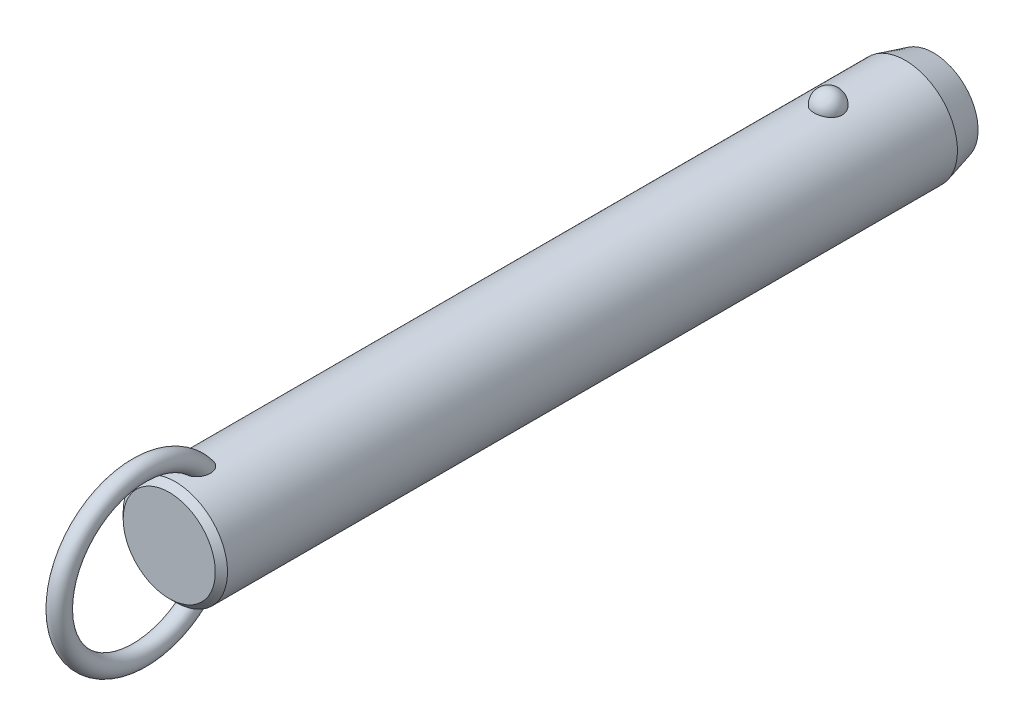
ISO-10303-21;
HEADER;
FILE_DESCRIPTION(('STEP AP214'),'2;1');
FILE_NAME('part.step','',(''),(''),'','','');
FILE_SCHEMA(('AUTOMOTIVE_DESIGN { 1 0 10303 214 1 1 1 1 }'));
ENDSEC;
DATA;
#1=APPLICATION_CONTEXT('core data for automotive mechanical design processes');
#2=APPLICATION_PROTOCOL_DEFINITION('international standard','automotive_design',2000,#1);
#3=PRODUCT_CONTEXT('',#1,'mechanical');
#4=PRODUCT('Part','Part','',(#3));
#5=PRODUCT_RELATED_PRODUCT_CATEGORY('part','',(#4));
#6=PRODUCT_DEFINITION_FORMATION('','',#4);
#7=PRODUCT_DEFINITION_CONTEXT('part definition',#1,'design');
#8=PRODUCT_DEFINITION('design','',#6,#7);
#9=PRODUCT_DEFINITION_SHAPE('','',#8);
#10=(LENGTH_UNIT() NAMED_UNIT(*) SI_UNIT(.MILLI.,.METRE.));
#11=(NAMED_UNIT(*) PLANE_ANGLE_UNIT() SI_UNIT($,.RADIAN.));
#12=(NAMED_UNIT(*) SI_UNIT($,.STERADIAN.) SOLID_ANGLE_UNIT());
#13=UNCERTAINTY_MEASURE_WITH_UNIT(LENGTH_MEASURE(1.E-05),#10,'distance_accuracy_value','');
#14=(GEOMETRIC_REPRESENTATION_CONTEXT(3) GLOBAL_UNCERTAINTY_ASSIGNED_CONTEXT((#13)) GLOBAL_UNIT_ASSIGNED_CONTEXT((#10,
#11,#12)) REPRESENTATION_CONTEXT('',''));
#15=CARTESIAN_POINT('',(0.,0.,0.));
#16=DIRECTION('',(0.,0.,1.));
#17=DIRECTION('',(1.,0.,0.));
#18=AXIS2_PLACEMENT_3D('',#15,#16,#17);
#19=CARTESIAN_POINT('',(0.,0.,124.5));
#20=DIRECTION('',(0.,0.,-1.));
#21=DIRECTION('',(-1.,0.,0.));
#22=AXIS2_PLACEMENT_3D('',#19,#20,#21);
#23=CYLINDRICAL_SURFACE('',#22,11.1);
#24=CARTESIAN_POINT('',(2.9724815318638,10.6945945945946,-3.));
#25=CARTESIAN_POINT('',(2.97247830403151,10.6945972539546,-2.83225059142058));
#26=CARTESIAN_POINT('',(2.95876598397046,10.6984356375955,-2.66445972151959));
#27=CARTESIAN_POINT('',(2.90424529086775,10.7133624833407,-2.33362381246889));
#28=CARTESIAN_POINT('',(2.8634252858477,10.7244540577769,-2.1705808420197));
#29=CARTESIAN_POINT('',(2.75573657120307,10.7526272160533,-1.85396767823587));
#30=CARTESIAN_POINT('',(2.68887937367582,10.7697061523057,-1.70039333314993));
#31=CARTESIAN_POINT('',(2.53079696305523,10.8079438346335,-1.40691598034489));
#32=CARTESIAN_POINT('',(2.43957264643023,10.8291024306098,-1.2670124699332));
#33=CARTESIAN_POINT('',(2.23458150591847,10.8732541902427,-1.00409565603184));
#34=CARTESIAN_POINT('',(2.12071295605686,10.8962553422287,-0.881162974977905));
#35=CARTESIAN_POINT('',(1.87365402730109,10.9414421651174,-0.656352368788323));
#36=CARTESIAN_POINT('',(1.74046358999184,10.9636278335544,-0.554474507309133));
#37=CARTESIAN_POINT('',(1.45872188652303,11.0046495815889,-0.374872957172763));
#38=CARTESIAN_POINT('',(1.31021276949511,11.0234944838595,-0.297085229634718));
#39=CARTESIAN_POINT('',(1.00170030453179,11.0557957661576,-0.167529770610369));
#40=CARTESIAN_POINT('',(0.841698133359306,11.0692526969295,-0.115759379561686));
#41=CARTESIAN_POINT('',(0.517607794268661,11.0890932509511,-0.0403925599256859));
#42=CARTESIAN_POINT('',(0.353633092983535,11.0955916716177,-0.0163383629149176));
#43=CARTESIAN_POINT('',(0.0238420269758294,11.1011989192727,0.0044517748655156));
#44=CARTESIAN_POINT('',(-0.141974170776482,11.1003084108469,0.00119017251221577));
#45=CARTESIAN_POINT('',(-0.468405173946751,11.0912990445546,-0.0323233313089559));
#46=CARTESIAN_POINT('',(-0.629059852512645,11.0832767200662,-0.0622147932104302));
#47=CARTESIAN_POINT('',(-0.942937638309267,11.0609962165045,-0.147645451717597));
#48=CARTESIAN_POINT('',(-1.09616062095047,11.0467379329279,-0.203185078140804));
#49=CARTESIAN_POINT('',(-1.39181061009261,11.0134071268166,-0.3387529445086));
#50=CARTESIAN_POINT('',(-1.53417383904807,10.9943086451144,-0.418913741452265));
#51=CARTESIAN_POINT('',(-1.80342160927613,10.9533667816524,-0.60144882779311));
#52=CARTESIAN_POINT('',(-1.9303046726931,10.9315231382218,-0.703825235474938));
#53=CARTESIAN_POINT('',(-2.16747598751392,10.887005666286,-0.930091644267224));
#54=CARTESIAN_POINT('',(-2.27742774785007,10.8643239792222,-1.05433291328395));
#55=CARTESIAN_POINT('',(-2.47517316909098,10.8209886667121,-1.31966633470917));
#56=CARTESIAN_POINT('',(-2.56296538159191,10.8003351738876,-1.46075958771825));
#57=CARTESIAN_POINT('',(-2.71500300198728,10.7631304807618,-1.75753646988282));
#58=CARTESIAN_POINT('',(-2.77898901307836,10.7466250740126,-1.91335887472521));
#59=CARTESIAN_POINT('',(-2.88046189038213,10.7198747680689,-2.2339152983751));
#60=CARTESIAN_POINT('',(-2.91794947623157,10.709629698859,-2.39864907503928));
#61=CARTESIAN_POINT('',(-2.96537819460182,10.6965949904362,-2.73165170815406));
#62=CARTESIAN_POINT('',(-2.97542891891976,10.693775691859,-2.89990378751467));
#63=CARTESIAN_POINT('',(-2.96804271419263,10.6958279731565,-3.235752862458));
#64=CARTESIAN_POINT('',(-2.95060646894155,10.7006993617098,-3.40334987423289));
#65=CARTESIAN_POINT('',(-2.88883358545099,10.71753912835,-3.73233906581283));
#66=CARTESIAN_POINT('',(-2.84462026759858,10.7294749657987,-3.89375610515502));
#67=CARTESIAN_POINT('',(-2.73050447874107,10.7590797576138,-4.20667949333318));
#68=CARTESIAN_POINT('',(-2.66060103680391,10.7767489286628,-4.35818546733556));
#69=CARTESIAN_POINT('',(-2.49642559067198,10.8159599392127,-4.6478542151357));
#70=CARTESIAN_POINT('',(-2.40203047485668,10.8375211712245,-4.78594458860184));
#71=CARTESIAN_POINT('',(-2.19143488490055,10.8820570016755,-5.0441038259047));
#72=CARTESIAN_POINT('',(-2.07523364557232,10.9050316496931,-5.16417205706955));
#73=CARTESIAN_POINT('',(-1.82361254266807,10.9499219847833,-5.38334833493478));
#74=CARTESIAN_POINT('',(-1.68812945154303,10.9718338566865,-5.48238464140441));
#75=CARTESIAN_POINT('',(-1.40191298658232,11.0120611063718,-5.65618873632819));
#76=CARTESIAN_POINT('',(-1.25118062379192,11.0303767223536,-5.73095813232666));
#77=CARTESIAN_POINT('',(-0.940570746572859,11.0611653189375,-5.85334725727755));
#78=CARTESIAN_POINT('',(-0.780821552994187,11.0737044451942,-5.90127578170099));
#79=CARTESIAN_POINT('',(-0.455204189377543,11.0918598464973,-5.96992976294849));
#80=CARTESIAN_POINT('',(-0.289336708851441,11.0974768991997,-5.99065827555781));
#81=CARTESIAN_POINT('',(0.0406846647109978,11.1011307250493,-6.00418773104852));
#82=CARTESIAN_POINT('',(0.204817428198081,11.099299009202,-5.99747318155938));
#83=CARTESIAN_POINT('',(0.5295530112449,11.088551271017,-5.9574031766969));
#84=CARTESIAN_POINT('',(0.69015594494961,11.0796354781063,-5.92404858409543));
#85=CARTESIAN_POINT('',(1.0027760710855,11.0557204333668,-5.83180084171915));
#86=CARTESIAN_POINT('',(1.15482001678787,11.0407414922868,-5.77299291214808));
#87=CARTESIAN_POINT('',(1.44678373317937,11.0062913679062,-5.63147366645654));
#88=CARTESIAN_POINT('',(1.58670279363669,10.9868199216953,-5.54876095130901));
#89=CARTESIAN_POINT('',(1.8527023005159,10.9451315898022,-5.36027644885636));
#90=CARTESIAN_POINT('',(1.97855158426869,10.9228788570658,-5.25418644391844));
#91=CARTESIAN_POINT('',(2.21080872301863,10.8782509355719,-5.02251354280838));
#92=CARTESIAN_POINT('',(2.31721312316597,10.8558757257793,-4.89692718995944));
#93=CARTESIAN_POINT('',(2.5094551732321,10.8130715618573,-4.62745408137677));
#94=CARTESIAN_POINT('',(2.59493284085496,10.7926798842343,-4.48330448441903));
#95=CARTESIAN_POINT('',(2.740862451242,10.7565495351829,-4.18236358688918));
#96=CARTESIAN_POINT('',(2.80132490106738,10.7408089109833,-4.02557762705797));
#97=CARTESIAN_POINT('',(2.88959070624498,10.7173718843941,-3.72475308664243));
#98=CARTESIAN_POINT('',(2.92062102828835,10.7088950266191,-3.58171216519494));
#99=CARTESIAN_POINT('',(2.96206765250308,10.6975052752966,-3.29245795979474));
#100=CARTESIAN_POINT('',(2.97248434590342,10.6945922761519,-3.14624473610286));
#101=CARTESIAN_POINT('',(2.9724815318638,10.6945945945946,-3.));
#102=B_SPLINE_CURVE_WITH_KNOTS('',3,(#24,#25,#26,#27,#28,#29,#30,#31,#32,#33,#34,#35,#36,#37,
#38,#39,#40,#41,#42,#43,#44,#45,#46,#47,#48,#49,#50,#51,#52,#53,#54,#55,#56,#57,#58,#59,#60,#61,
#62,#63,#64,#65,#66,#67,#68,#69,#70,#71,#72,#73,#74,#75,#76,#77,#78,#79,#80,#81,#82,#83,#84,#85,
#86,#87,#88,#89,#90,#91,#92,#93,#94,#95,#96,#97,#98,#99,#100,#101),.UNSPECIFIED.,.T.,.F.,(4,2,2,
2,2,2,2,2,2,2,2,2,2,2,2,2,2,2,2,2,2,2,2,2,2,2,2,2,2,2,2,2,2,2,2,2,2,2,4),(0.,0.502722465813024,
1.00566079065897,1.5083769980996,2.01107471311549,2.51608392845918,3.02109467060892,
3.52475118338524,4.02835620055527,4.523518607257,5.0186364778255,5.50715297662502,
5.9956776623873,6.48688002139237,6.97812923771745,7.47814366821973,7.9781907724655,
8.48353712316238,8.9888697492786,9.49218093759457,9.99547960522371,10.4964777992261,
10.997494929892,11.5010810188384,12.0046847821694,12.5099796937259,13.0152411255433,
13.5145635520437,14.0138298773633,14.5043200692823,14.9947943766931,15.4836390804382,
15.9725123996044,16.4685040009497,16.9645836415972,17.4686765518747,17.972557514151,
18.410841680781,18.849117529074),.UNSPECIFIED.);
#103=CARTESIAN_POINT('',(2.9724815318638,10.6945945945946,-3.));
#104=VERTEX_POINT('',#103);
#105=EDGE_CURVE('E41',#104,#104,#102,.T.);
#106=ORIENTED_EDGE('',*,*,#105,.T.);
#107=EDGE_LOOP('',(#106));
#108=FACE_BOUND('',#107,.T.);
#109=CARTESIAN_POINT('',(0.,0.,135.9));
#110=DIRECTION('',(0.,0.,1.));
#111=DIRECTION('',(1.,0.,0.));
#112=AXIS2_PLACEMENT_3D('',#109,#110,#111);
#113=CIRCLE('',#112,11.1);
#114=CARTESIAN_POINT('',(-11.1,0.,135.9));
#115=VERTEX_POINT('',#114);
#116=EDGE_CURVE('E10',#115,#115,#113,.F.);
#117=ORIENTED_EDGE('',*,*,#116,.T.);
#118=EDGE_LOOP('',(#117));
#119=FACE_BOUND('',#118,.T.);
#120=CARTESIAN_POINT('',(-0.564520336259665,-11.0856356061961,128.157815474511));
#121=CARTESIAN_POINT('',(-0.667202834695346,-11.0804062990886,128.191283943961));
#122=CARTESIAN_POINT('',(-0.766875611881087,-11.0738877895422,128.233835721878));
#123=CARTESIAN_POINT('',(-0.95728412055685,-11.0590576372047,128.335419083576));
#124=CARTESIAN_POINT('',(-1.04801616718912,-11.0507452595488,128.39445742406));
#125=CARTESIAN_POINT('',(-1.21800952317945,-11.0333016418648,128.526529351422));
#126=CARTESIAN_POINT('',(-1.2973080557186,-11.0241732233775,128.599515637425));
#127=CARTESIAN_POINT('',(-1.44337665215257,-11.0060026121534,128.757037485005));
#128=CARTESIAN_POINT('',(-1.51014622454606,-10.9969604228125,128.841573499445));
#129=CARTESIAN_POINT('',(-1.63454620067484,-10.9791841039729,129.025521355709));
#130=CARTESIAN_POINT('',(-1.69127003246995,-10.9705107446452,129.125549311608));
#131=CARTESIAN_POINT('',(-1.7898078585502,-10.9548648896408,129.332790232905));
#132=CARTESIAN_POINT('',(-1.83161214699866,-10.9478935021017,129.440007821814));
#133=CARTESIAN_POINT('',(-1.91557028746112,-10.9335803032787,129.705408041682));
#134=CARTESIAN_POINT('',(-1.95040620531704,-10.9273269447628,129.865980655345));
#135=CARTESIAN_POINT('',(-1.99388326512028,-10.9194709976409,130.190697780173));
#136=CARTESIAN_POINT('',(-2.00248051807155,-10.9178762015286,130.354847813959));
#137=CARTESIAN_POINT('',(-1.99551615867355,-10.9191578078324,130.724650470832));
#138=CARTESIAN_POINT('',(-1.9732206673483,-10.9232807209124,130.930191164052));
#139=CARTESIAN_POINT('',(-1.9152976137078,-10.9335244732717,131.233595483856));
#140=CARTESIAN_POINT('',(-1.89184575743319,-10.9376266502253,131.334088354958));
#141=CARTESIAN_POINT('',(-1.83700674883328,-10.9469720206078,131.532855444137));
#142=CARTESIAN_POINT('',(-1.80562070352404,-10.9522150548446,131.631129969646));
#143=CARTESIAN_POINT('',(-1.73463055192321,-10.9636837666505,131.825914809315));
#144=CARTESIAN_POINT('',(-1.69493416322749,-10.9699202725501,131.922390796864));
#145=CARTESIAN_POINT('',(-1.60745141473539,-10.9830806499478,132.111626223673));
#146=CARTESIAN_POINT('',(-1.55966150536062,-10.9900048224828,132.204384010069));
#147=CARTESIAN_POINT('',(-1.45591812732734,-11.0042280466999,132.384690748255));
#148=CARTESIAN_POINT('',(-1.40000013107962,-11.0115253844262,132.472260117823));
#149=CARTESIAN_POINT('',(-1.27937470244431,-11.0261911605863,132.641029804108));
#150=CARTESIAN_POINT('',(-1.21467835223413,-11.0335594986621,132.72223795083));
#151=CARTESIAN_POINT('',(-1.08218150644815,-11.0473027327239,132.869001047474));
#152=CARTESIAN_POINT('',(-1.01522633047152,-11.0537063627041,132.935309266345));
#153=CARTESIAN_POINT('',(-0.872952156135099,-11.065850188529,133.058378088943));
#154=CARTESIAN_POINT('',(-0.797642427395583,-11.0715911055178,133.115149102));
#155=CARTESIAN_POINT('',(-0.651396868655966,-11.081071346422,133.207515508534));
#156=CARTESIAN_POINT('',(-0.581712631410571,-11.0849841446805,133.245049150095));
#157=CARTESIAN_POINT('',(-0.437066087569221,-11.0916271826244,133.308259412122));
#158=CARTESIAN_POINT('',(-0.362109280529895,-11.0943586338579,133.333948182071));
#159=CARTESIAN_POINT('',(-0.207828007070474,-11.0983242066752,133.371117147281));
#160=CARTESIAN_POINT('',(-0.12846771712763,-11.0995432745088,133.382454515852));
#161=CARTESIAN_POINT('',(0.0309101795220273,-11.1002423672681,133.388965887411));
#162=CARTESIAN_POINT('',(0.110927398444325,-11.0997233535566,133.384148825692));
#163=CARTESIAN_POINT('',(0.25640659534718,-11.097240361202,133.360959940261));
#164=CARTESIAN_POINT('',(0.322235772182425,-11.0955074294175,133.344754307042));
#165=CARTESIAN_POINT('',(0.450635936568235,-11.0910350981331,133.302600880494));
#166=CARTESIAN_POINT('',(0.513205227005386,-11.0882951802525,133.276648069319));
#167=CARTESIAN_POINT('',(0.662626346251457,-11.0805620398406,133.202607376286));
#168=CARTESIAN_POINT('',(0.747127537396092,-11.0751144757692,133.149845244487));
#169=CARTESIAN_POINT('',(0.906756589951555,-11.0631932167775,133.031720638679));
#170=CARTESIAN_POINT('',(0.981859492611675,-11.0567168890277,132.966325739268));
#171=CARTESIAN_POINT('',(1.10712207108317,-11.0447856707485,132.84226337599));
#172=CARTESIAN_POINT('',(1.15909566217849,-11.0394280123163,132.785383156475));
#173=CARTESIAN_POINT('',(1.2579192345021,-11.0286040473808,132.667327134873));
#174=CARTESIAN_POINT('',(1.30476642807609,-11.0231376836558,132.606149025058));
#175=CARTESIAN_POINT('',(1.43818612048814,-11.0068027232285,132.417305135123));
#176=CARTESIAN_POINT('',(1.51751767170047,-10.9960104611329,132.284453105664));
#177=CARTESIAN_POINT('',(1.63597546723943,-10.9788847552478,132.053137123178));
#178=CARTESIAN_POINT('',(1.67988876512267,-10.9722190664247,131.957053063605));
#179=CARTESIAN_POINT('',(1.75953241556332,-10.9597298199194,131.761431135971));
#180=CARTESIAN_POINT('',(1.7952596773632,-10.9539065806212,131.661891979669));
#181=CARTESIAN_POINT('',(1.85844731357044,-10.9433632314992,131.46021118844));
#182=CARTESIAN_POINT('',(1.88591073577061,-10.9386427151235,131.35807052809));
#183=CARTESIAN_POINT('',(1.93234324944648,-10.9305350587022,131.151819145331));
#184=CARTESIAN_POINT('',(1.95131065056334,-10.9271481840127,131.047708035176));
#185=CARTESIAN_POINT('',(1.9904020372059,-10.9201183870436,130.765458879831));
#186=CARTESIAN_POINT('',(2.00221217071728,-10.9179256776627,130.586037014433));
#187=CARTESIAN_POINT('',(1.99711676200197,-10.9188636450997,130.227713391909));
#188=CARTESIAN_POINT('',(1.98026150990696,-10.9219849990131,130.048811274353));
#189=CARTESIAN_POINT('',(1.92151657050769,-10.9324473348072,129.73645144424));
#190=CARTESIAN_POINT('',(1.88605081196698,-10.9386915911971,129.601759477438));
#191=CARTESIAN_POINT('',(1.79393020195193,-10.9541780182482,129.339966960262));
#192=CARTESIAN_POINT('',(1.73729868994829,-10.9634168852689,129.212858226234));
#193=CARTESIAN_POINT('',(1.61237037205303,-10.9824218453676,128.989418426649));
#194=CARTESIAN_POINT('',(1.54715374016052,-10.9918945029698,128.891345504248));
#195=CARTESIAN_POINT('',(1.40127026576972,-11.0114415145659,128.707434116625));
#196=CARTESIAN_POINT('',(1.32060742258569,-11.0215157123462,128.621592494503));
#197=CARTESIAN_POINT('',(1.1447478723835,-11.041168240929,128.465163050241));
#198=CARTESIAN_POINT('',(1.04947805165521,-11.0507437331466,128.394656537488));
#199=CARTESIAN_POINT('',(0.847278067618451,-11.0680789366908,128.272640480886));
#200=CARTESIAN_POINT('',(0.74035174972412,-11.0758392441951,128.221124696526));
#201=CARTESIAN_POINT('',(0.529289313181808,-11.0878275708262,128.143485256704));
#202=CARTESIAN_POINT('',(0.425895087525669,-11.0923259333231,128.115377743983));
#203=CARTESIAN_POINT('',(0.215723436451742,-11.0984001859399,128.077703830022));
#204=CARTESIAN_POINT('',(0.108947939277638,-11.0999777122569,128.068127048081));
#205=CARTESIAN_POINT('',(-0.0938962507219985,-11.1000196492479,128.067877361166));
#206=CARTESIAN_POINT('',(-0.189967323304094,-11.0987797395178,128.075408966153));
#207=CARTESIAN_POINT('',(-0.379657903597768,-11.0939111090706,128.105507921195));
#208=CARTESIAN_POINT('',(-0.47327735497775,-11.0902823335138,128.128075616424));
#209=CARTESIAN_POINT('',(-0.564520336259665,-11.0856356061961,128.157815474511));
#210=B_SPLINE_CURVE_WITH_KNOTS('',3,(#120,#121,#122,#123,#124,#125,#126,#127,#128,#129,#130,
#131,#132,#133,#134,#135,#136,#137,#138,#139,#140,#141,#142,#143,#144,#145,#146,#147,#148,#149,
#150,#151,#152,#153,#154,#155,#156,#157,#158,#159,#160,#161,#162,#163,#164,#165,#166,#167,#168,
#169,#170,#171,#172,#173,#174,#175,#176,#177,#178,#179,#180,#181,#182,#183,#184,#185,#186,#187,
#188,#189,#190,#191,#192,#193,#194,#195,#196,#197,#198,#199,#200,#201,#202,#203,#204,#205,#206,
#207,#208,#209),.UNSPECIFIED.,.T.,.F.,(4,2,2,2,2,2,2,2,2,2,2,2,2,2,2,2,2,2,2,2,2,2,2,2,2,2,2,2,
2,2,2,2,2,2,2,2,2,2,2,2,2,2,2,2,4),(0.,0.323999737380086,0.64813245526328,0.971184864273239,
1.29424994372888,1.63886237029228,1.98369857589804,2.47426059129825,2.96564271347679,
3.58257396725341,3.89215258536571,4.20168803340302,4.51486273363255,4.82817514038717,
5.14015911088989,5.45175282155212,5.73442856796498,6.01679375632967,6.2536458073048,
6.49025437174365,6.72919963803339,6.96801276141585,7.17061258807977,7.37331685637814,
7.67094989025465,7.96935728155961,8.20075067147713,8.43226927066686,8.89581623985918,
9.21306533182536,9.53043400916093,9.84768549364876,10.1650000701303,10.7022930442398,
11.2386443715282,11.655339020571,12.071575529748,12.4245637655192,12.7774607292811,
13.1321855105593,13.4867936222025,13.8068771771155,14.1267813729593,14.4146787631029,
14.7025827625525),.UNSPECIFIED.);
#211=CARTESIAN_POINT('',(-0.564520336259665,-11.0856356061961,128.157815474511));
#212=VERTEX_POINT('',#211);
#213=EDGE_CURVE('E60',#212,#212,#210,.T.);
#214=ORIENTED_EDGE('',*,*,#213,.T.);
#215=EDGE_LOOP('',(#214));
#216=FACE_BOUND('',#215,.T.);
#217=CARTESIAN_POINT('',(-0.564520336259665,11.0856356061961,128.157815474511));
#218=CARTESIAN_POINT('',(-0.468542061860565,11.0905203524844,128.126545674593));
#219=CARTESIAN_POINT('',(-0.369793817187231,11.0942886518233,128.103157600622));
#220=CARTESIAN_POINT('',(-0.169555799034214,11.0991586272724,128.073085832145));
#221=CARTESIAN_POINT('',(-0.0680604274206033,11.1002543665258,128.06643932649));
#222=CARTESIAN_POINT('',(0.134549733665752,11.099646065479,128.070157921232));
#223=CARTESIAN_POINT('',(0.235664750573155,11.0979441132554,128.08051033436));
#224=CARTESIAN_POINT('',(0.434632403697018,11.0919342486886,128.117831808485));
#225=CARTESIAN_POINT('',(0.532486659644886,11.0876276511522,128.144792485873));
#226=CARTESIAN_POINT('',(0.722445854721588,11.0768742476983,128.2144096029));
#227=CARTESIAN_POINT('',(0.814543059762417,11.0704246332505,128.257086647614));
#228=CARTESIAN_POINT('',(0.990565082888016,11.0560659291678,128.356648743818));
#229=CARTESIAN_POINT('',(1.07448844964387,11.048156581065,128.413536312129));
#230=CARTESIAN_POINT('',(1.23562672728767,11.0313221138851,128.542210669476));
#231=CARTESIAN_POINT('',(1.3124268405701,11.0223686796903,128.614511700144));
#232=CARTESIAN_POINT('',(1.45398030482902,11.0045918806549,128.770042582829));
#233=CARTESIAN_POINT('',(1.51873073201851,10.9957685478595,128.853275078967));
#234=CARTESIAN_POINT('',(1.64107232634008,10.9782087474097,129.036384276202));
#235=CARTESIAN_POINT('',(1.6974317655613,10.9695572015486,129.137089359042));
#236=CARTESIAN_POINT('',(1.79515063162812,10.9539887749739,129.345626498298));
#237=CARTESIAN_POINT('',(1.83649966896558,10.9470730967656,129.45346343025));
#238=CARTESIAN_POINT('',(1.91931148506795,10.9329211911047,129.720399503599));
#239=CARTESIAN_POINT('',(1.95340104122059,10.9267904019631,129.881861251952));
#240=CARTESIAN_POINT('',(1.99526195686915,10.9192174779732,130.20821631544));
#241=CARTESIAN_POINT('',(2.00298989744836,10.9177830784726,130.37311484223));
#242=CARTESIAN_POINT('',(1.99396251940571,10.9194420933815,130.744100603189));
#243=CARTESIAN_POINT('',(1.97050829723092,10.923774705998,130.95003871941));
#244=CARTESIAN_POINT('',(1.91079643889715,10.9343131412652,131.253901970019));
#245=CARTESIAN_POINT('',(1.88673702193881,10.9385106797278,131.354529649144));
#246=CARTESIAN_POINT('',(1.8306550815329,10.9480376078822,131.553510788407));
#247=CARTESIAN_POINT('',(1.79863369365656,10.9533668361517,131.651864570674));
#248=CARTESIAN_POINT('',(1.72633365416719,10.9649954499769,131.846720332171));
#249=CARTESIAN_POINT('',(1.68596409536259,10.9713053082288,131.94318790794));
#250=CARTESIAN_POINT('',(1.59707998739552,10.9845964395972,132.132323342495));
#251=CARTESIAN_POINT('',(1.54856169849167,10.9915780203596,132.224989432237));
#252=CARTESIAN_POINT('',(1.44330168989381,11.0058935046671,132.404975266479));
#253=CARTESIAN_POINT('',(1.3865974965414,11.0132257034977,132.492316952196));
#254=CARTESIAN_POINT('',(1.26431158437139,11.0279330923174,132.660456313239));
#255=CARTESIAN_POINT('',(1.19874160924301,11.0353082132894,132.741262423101));
#256=CARTESIAN_POINT('',(1.06542088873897,11.048931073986,132.885985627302));
#257=CARTESIAN_POINT('',(0.998640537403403,11.0552153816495,132.950784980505));
#258=CARTESIAN_POINT('',(0.856896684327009,11.0671032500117,133.070846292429));
#259=CARTESIAN_POINT('',(0.781942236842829,11.0727075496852,133.126118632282));
#260=CARTESIAN_POINT('',(0.636276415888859,11.081949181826,133.215972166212));
#261=CARTESIAN_POINT('',(0.566755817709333,11.0857572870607,133.252441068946));
#262=CARTESIAN_POINT('',(0.422602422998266,11.0921860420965,133.313533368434));
#263=CARTESIAN_POINT('',(0.347974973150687,11.0948079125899,133.338168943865));
#264=CARTESIAN_POINT('',(0.194593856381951,11.0985608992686,133.373323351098));
#265=CARTESIAN_POINT('',(0.115807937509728,11.0996777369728,133.383706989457));
#266=CARTESIAN_POINT('',(-0.0422499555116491,11.1002003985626,133.388574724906));
#267=CARTESIAN_POINT('',(-0.121521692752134,11.09960699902,133.383066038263));
#268=CARTESIAN_POINT('',(-0.266046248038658,11.0970123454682,133.358827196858));
#269=CARTESIAN_POINT('',(-0.331661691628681,11.0952283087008,133.342135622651));
#270=CARTESIAN_POINT('',(-0.459588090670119,11.0906663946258,133.299111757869));
#271=CARTESIAN_POINT('',(-0.52189737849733,11.0878880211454,133.272774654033));
#272=CARTESIAN_POINT('',(-0.671446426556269,11.0800342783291,133.197513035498));
#273=CARTESIAN_POINT('',(-0.756250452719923,11.0744969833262,133.143818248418));
#274=CARTESIAN_POINT('',(-0.916349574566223,11.0624045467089,133.023802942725));
#275=CARTESIAN_POINT('',(-0.991618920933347,11.0558467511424,132.957449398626));
#276=CARTESIAN_POINT('',(-1.11713140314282,11.0437783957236,132.831633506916));
#277=CARTESIAN_POINT('',(-1.1692053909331,11.0383619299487,132.773952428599));
#278=CARTESIAN_POINT('',(-1.26817476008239,11.02743010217,132.654280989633));
#279=CARTESIAN_POINT('',(-1.31506731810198,11.0219146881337,132.592288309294));
#280=CARTESIAN_POINT('',(-1.40399813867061,11.0109399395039,132.464784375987));
#281=CARTESIAN_POINT('',(-1.44602864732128,11.0054807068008,132.399267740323));
#282=CARTESIAN_POINT('',(-1.52538779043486,10.9947621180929,132.265422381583));
#283=CARTESIAN_POINT('',(-1.56271516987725,10.9895028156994,132.197092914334));
#284=CARTESIAN_POINT('',(-1.64537943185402,10.9774790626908,132.033210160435));
#285=CARTESIAN_POINT('',(-1.68879497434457,10.9708503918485,131.9366735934));
#286=CARTESIAN_POINT('',(-1.76740738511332,10.9584602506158,131.740236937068));
#287=CARTESIAN_POINT('',(-1.80260120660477,10.95269910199,131.64033561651));
#288=CARTESIAN_POINT('',(-1.86468657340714,10.9423003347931,131.437966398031));
#289=CARTESIAN_POINT('',(-1.8915816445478,10.9376622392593,131.335499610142));
#290=CARTESIAN_POINT('',(-1.93682458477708,10.9297405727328,131.128642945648));
#291=CARTESIAN_POINT('',(-1.95517082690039,10.9264572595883,131.024252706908));
#292=CARTESIAN_POINT('',(-1.99232562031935,10.9197647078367,130.74262876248));
#293=CARTESIAN_POINT('',(-2.00294603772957,10.9177914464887,130.564185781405));
#294=CARTESIAN_POINT('',(-1.99566675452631,10.9191290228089,130.207996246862));
#295=CARTESIAN_POINT('',(-1.97781651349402,10.9224306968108,130.03024902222));
#296=CARTESIAN_POINT('',(-1.91747214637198,10.9331592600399,129.719792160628));
#297=CARTESIAN_POINT('',(-1.88131022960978,10.9395108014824,129.585825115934));
#298=CARTESIAN_POINT('',(-1.78790380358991,10.9551659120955,129.32559757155));
#299=CARTESIAN_POINT('',(-1.73068309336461,10.9644661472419,129.199328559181));
#300=CARTESIAN_POINT('',(-1.60475573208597,10.9835398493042,128.97741565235));
#301=CARTESIAN_POINT('',(-1.53908879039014,10.9930297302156,128.880026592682));
#302=CARTESIAN_POINT('',(-1.39238608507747,11.0125708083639,128.697525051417));
#303=CARTESIAN_POINT('',(-1.31135150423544,11.0226219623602,128.612411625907));
#304=CARTESIAN_POINT('',(-1.14382035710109,11.0411991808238,128.46529943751));
#305=CARTESIAN_POINT('',(-1.0585850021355,11.0497792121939,128.40186930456));
#306=CARTESIAN_POINT('',(-0.878723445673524,11.0655285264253,128.290250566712));
#307=CARTESIAN_POINT('',(-0.784123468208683,11.0727015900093,128.242020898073));
#308=CARTESIAN_POINT('',(-0.646163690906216,11.0812501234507,128.186023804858));
#309=CARTESIAN_POINT('',(-0.605595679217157,11.0835451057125,128.171197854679));
#310=CARTESIAN_POINT('',(-0.564520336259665,11.0856356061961,128.157815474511));
#311=B_SPLINE_CURVE_WITH_KNOTS('',3,(#217,#218,#219,#220,#221,#222,#223,#224,#225,#226,#227,
#228,#229,#230,#231,#232,#233,#234,#235,#236,#237,#238,#239,#240,#241,#242,#243,#244,#245,#246,
#247,#248,#249,#250,#251,#252,#253,#254,#255,#256,#257,#258,#259,#260,#261,#262,#263,#264,#265,
#266,#267,#268,#269,#270,#271,#272,#273,#274,#275,#276,#277,#278,#279,#280,#281,#282,#283,#284,
#285,#286,#287,#288,#289,#290,#291,#292,#293,#294,#295,#296,#297,#298,#299,#300,#301,#302,#303,
#304,#305,#306,#307,#308,#309,#310),.UNSPECIFIED.,.T.,.F.,(4,2,2,2,2,2,2,2,2,2,2,2,2,2,2,2,2,2,
2,2,2,2,2,2,2,2,2,2,2,2,2,2,2,2,2,2,2,2,2,2,2,2,2,2,2,2,4),(0.,0.303061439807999,
0.606795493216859,0.910302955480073,1.21365733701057,1.51741085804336,1.82121821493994,
2.13745205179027,2.45376252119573,2.79958678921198,3.14564996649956,3.63832391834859,
4.13180893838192,4.75031912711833,5.06071926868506,5.37107516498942,5.6850077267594,
5.99908475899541,6.31176519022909,6.62403542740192,6.90315673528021,7.18197194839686,
7.41687778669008,7.65154134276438,7.88841587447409,8.12518286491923,8.32752842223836,
8.52997509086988,8.82986421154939,9.13054668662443,9.36393502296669,9.5974499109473,
9.83133221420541,10.0652767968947,10.383032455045,10.7009056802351,11.0186436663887,
11.3364420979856,11.8705925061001,12.4038159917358,12.8189662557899,13.2336487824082,
13.5857049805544,13.9377340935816,14.2561354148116,14.5736690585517,14.7033687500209),.UNSPECIFIED.);
#312=CARTESIAN_POINT('',(-0.564520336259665,11.0856356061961,128.157815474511));
#313=VERTEX_POINT('',#312);
#314=EDGE_CURVE('E68',#313,#313,#311,.T.);
#315=ORIENTED_EDGE('',*,*,#314,.T.);
#316=EDGE_LOOP('',(#315));
#317=FACE_BOUND('',#316,.T.);
#318=CARTESIAN_POINT('',(0.,0.,-19.3999999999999));
#319=DIRECTION('',(0.,0.,-1.));
#320=DIRECTION('',(-1.,0.,0.));
#321=AXIS2_PLACEMENT_3D('',#318,#319,#320);
#322=CIRCLE('',#321,11.1);
#323=CARTESIAN_POINT('',(-11.1,0.,-19.3999999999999));
#324=VERTEX_POINT('',#323);
#325=EDGE_CURVE('E57',#324,#324,#322,.F.);
#326=ORIENTED_EDGE('',*,*,#325,.T.);
#327=EDGE_LOOP('',(#326));
#328=FACE_BOUND('',#327,.T.);
#329=ADVANCED_FACE('F37',(#108,#119,#216,#317,#328),#23,.T.);
#330=CARTESIAN_POINT('',(0.,0.,-25.4));
#331=DIRECTION('',(0.,0.,-1.));
#332=DIRECTION('',(-1.,0.,0.));
#333=AXIS2_PLACEMENT_3D('',#330,#331,#332);
#334=PLANE('',#333);
#335=CARTESIAN_POINT('',(0.,0.,-25.4));
#336=DIRECTION('',(0.,0.,-1.));
#337=DIRECTION('',(-1.,0.,0.));
#338=AXIS2_PLACEMENT_3D('',#335,#336,#337);
#339=CIRCLE('',#338,9.49230484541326);
#340=CARTESIAN_POINT('',(-9.49230484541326,0.,-25.4));
#341=VERTEX_POINT('',#340);
#342=EDGE_CURVE('E67',#341,#341,#339,.T.);
#343=ORIENTED_EDGE('',*,*,#342,.T.);
#344=EDGE_LOOP('',(#343));
#345=FACE_BOUND('',#344,.T.);
#346=ADVANCED_FACE('F86',(#345),#334,.T.);
#347=CARTESIAN_POINT('',(0.,0.,-25.4));
#348=DIRECTION('',(0.,0.,1.));
#349=DIRECTION('',(1.,0.,0.));
#350=AXIS2_PLACEMENT_3D('',#347,#348,#349);
#351=CONICAL_SURFACE('',#350,9.49230484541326,0.261799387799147);
#352=ORIENTED_EDGE('',*,*,#325,.F.);
#353=EDGE_LOOP('',(#352));
#354=FACE_BOUND('',#353,.T.);
#355=ORIENTED_EDGE('',*,*,#342,.F.);
#356=EDGE_LOOP('',(#355));
#357=FACE_BOUND('',#356,.T.);
#358=ADVANCED_FACE('F84',(#354,#357),#351,.T.);
#359=CARTESIAN_POINT('',(0.,0.,137.2));
#360=DIRECTION('',(0.,0.,1.));
#361=DIRECTION('',(1.,0.,0.));
#362=AXIS2_PLACEMENT_3D('',#359,#360,#361);
#363=PLANE('',#362);
#364=CARTESIAN_POINT('',(0.,0.,137.2));
#365=DIRECTION('',(0.,0.,1.));
#366=DIRECTION('',(1.,0.,0.));
#367=AXIS2_PLACEMENT_3D('',#364,#365,#366);
#368=CIRCLE('',#367,9.80000000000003);
#369=CARTESIAN_POINT('',(-9.80000000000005,0.,137.2));
#370=VERTEX_POINT('',#369);
#371=EDGE_CURVE('E50',#370,#370,#368,.T.);
#372=ORIENTED_EDGE('',*,*,#371,.T.);
#373=EDGE_LOOP('',(#372));
#374=FACE_BOUND('',#373,.T.);
#375=ADVANCED_FACE('F78',(#374),#363,.T.);
#376=CARTESIAN_POINT('',(0.,0.,143.55));
#377=DIRECTION('',(1.,0.,0.));
#378=DIRECTION('',(0.,0.,-1.));
#379=AXIS2_PLACEMENT_3D('',#376,#377,#378);
#380=TOROIDAL_SURFACE('',#379,17.05,2.);
#381=ORIENTED_EDGE('',*,*,#314,.F.);
#382=EDGE_LOOP('',(#381));
#383=FACE_BOUND('',#382,.T.);
#384=ORIENTED_EDGE('',*,*,#213,.F.);
#385=EDGE_LOOP('',(#384));
#386=FACE_BOUND('',#385,.T.);
#387=ADVANCED_FACE('F74',(#383,#386),#380,.T.);
#388=CARTESIAN_POINT('',(0.,0.,137.2));
#389=DIRECTION('',(0.,0.,-1.));
#390=DIRECTION('',(-1.,0.,0.));
#391=AXIS2_PLACEMENT_3D('',#388,#389,#390);
#392=CONICAL_SURFACE('',#391,9.80000000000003,0.785398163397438);
#393=CARTESIAN_POINT('',(-11.1,0.,135.9));
#394=CARTESIAN_POINT('',(-11.0864583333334,0.,135.913541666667));
#395=CARTESIAN_POINT('',(-11.0729166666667,0.,135.927083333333));
#396=CARTESIAN_POINT('',(-11.0458333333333,0.,135.954166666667));
#397=CARTESIAN_POINT('',(-11.0322916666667,0.,135.967708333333));
#398=CARTESIAN_POINT('',(-11.0052083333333,0.,135.994791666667));
#399=CARTESIAN_POINT('',(-10.9916666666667,0.,136.008333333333));
#400=CARTESIAN_POINT('',(-10.9645833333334,0.,136.035416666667));
#401=CARTESIAN_POINT('',(-10.9510416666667,0.,136.048958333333));
#402=CARTESIAN_POINT('',(-10.9239583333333,0.,136.076041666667));
#403=CARTESIAN_POINT('',(-10.9104166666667,0.,136.089583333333));
#404=CARTESIAN_POINT('',(-10.8833333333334,0.,136.116666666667));
#405=CARTESIAN_POINT('',(-10.8697916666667,0.,136.130208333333));
#406=CARTESIAN_POINT('',(-10.8427083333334,0.,136.157291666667));
#407=CARTESIAN_POINT('',(-10.8291666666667,0.,136.170833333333));
#408=CARTESIAN_POINT('',(-10.8020833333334,0.,136.197916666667));
#409=CARTESIAN_POINT('',(-10.7885416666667,0.,136.211458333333));
#410=CARTESIAN_POINT('',(-10.7614583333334,0.,136.238541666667));
#411=CARTESIAN_POINT('',(-10.7479166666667,0.,136.252083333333));
#412=CARTESIAN_POINT('',(-10.7208333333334,0.,136.279166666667));
#413=CARTESIAN_POINT('',(-10.7072916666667,0.,136.292708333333));
#414=CARTESIAN_POINT('',(-10.6802083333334,0.,136.319791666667));
#415=CARTESIAN_POINT('',(-10.6666666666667,0.,136.333333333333));
#416=CARTESIAN_POINT('',(-10.6395833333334,0.,136.360416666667));
#417=CARTESIAN_POINT('',(-10.6260416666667,0.,136.373958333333));
#418=CARTESIAN_POINT('',(-10.5989583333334,0.,136.401041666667));
#419=CARTESIAN_POINT('',(-10.5854166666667,0.,136.414583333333));
#420=CARTESIAN_POINT('',(-10.5583333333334,0.,136.441666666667));
#421=CARTESIAN_POINT('',(-10.5447916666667,0.,136.455208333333));
#422=CARTESIAN_POINT('',(-10.5177083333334,0.,136.482291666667));
#423=CARTESIAN_POINT('',(-10.5041666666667,0.,136.495833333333));
#424=CARTESIAN_POINT('',(-10.4770833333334,0.,136.522916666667));
#425=CARTESIAN_POINT('',(-10.4635416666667,0.,136.536458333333));
#426=CARTESIAN_POINT('',(-10.4364583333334,0.,136.563541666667));
#427=CARTESIAN_POINT('',(-10.4229166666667,0.,136.577083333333));
#428=CARTESIAN_POINT('',(-10.3958333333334,0.,136.604166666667));
#429=CARTESIAN_POINT('',(-10.3822916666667,0.,136.617708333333));
#430=CARTESIAN_POINT('',(-10.3552083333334,0.,136.644791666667));
#431=CARTESIAN_POINT('',(-10.3416666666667,0.,136.658333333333));
#432=CARTESIAN_POINT('',(-10.3145833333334,0.,136.685416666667));
#433=CARTESIAN_POINT('',(-10.3010416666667,0.,136.698958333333));
#434=CARTESIAN_POINT('',(-10.2739583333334,0.,136.726041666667));
#435=CARTESIAN_POINT('',(-10.2604166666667,0.,136.739583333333));
#436=CARTESIAN_POINT('',(-10.2333333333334,0.,136.766666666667));
#437=CARTESIAN_POINT('',(-10.2197916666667,0.,136.780208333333));
#438=CARTESIAN_POINT('',(-10.1927083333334,0.,136.807291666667));
#439=CARTESIAN_POINT('',(-10.1791666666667,0.,136.820833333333));
#440=CARTESIAN_POINT('',(-10.1520833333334,0.,136.847916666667));
#441=CARTESIAN_POINT('',(-10.1385416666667,0.,136.861458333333));
#442=CARTESIAN_POINT('',(-10.1114583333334,0.,136.888541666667));
#443=CARTESIAN_POINT('',(-10.0979166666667,0.,136.902083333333));
#444=CARTESIAN_POINT('',(-10.0708333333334,0.,136.929166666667));
#445=CARTESIAN_POINT('',(-10.0572916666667,0.,136.942708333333));
#446=CARTESIAN_POINT('',(-10.0302083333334,0.,136.969791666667));
#447=CARTESIAN_POINT('',(-10.0166666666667,0.,136.983333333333));
#448=CARTESIAN_POINT('',(-9.98958333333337,0.,137.010416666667));
#449=CARTESIAN_POINT('',(-9.97604166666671,0.,137.023958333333));
#450=CARTESIAN_POINT('',(-9.94895833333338,0.,137.051041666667));
#451=CARTESIAN_POINT('',(-9.93541666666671,0.,137.064583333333));
#452=CARTESIAN_POINT('',(-9.90833333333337,0.,137.091666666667));
#453=CARTESIAN_POINT('',(-9.89479166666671,0.,137.105208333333));
#454=CARTESIAN_POINT('',(-9.86770833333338,0.,137.132291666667));
#455=CARTESIAN_POINT('',(-9.85416666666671,0.,137.145833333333));
#456=CARTESIAN_POINT('',(-9.82708333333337,0.,137.172916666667));
#457=CARTESIAN_POINT('',(-9.8135416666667,0.,137.186458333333));
#458=CARTESIAN_POINT('',(-9.80000000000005,0.,137.2));
#459=B_SPLINE_CURVE_WITH_KNOTS('',3,(#393,#394,#395,#396,#397,#398,#399,#400,#401,#402,#403,
#404,#405,#406,#407,#408,#409,#410,#411,#412,#413,#414,#415,#416,#417,#418,#419,#420,#421,#422,
#423,#424,#425,#426,#427,#428,#429,#430,#431,#432,#433,#434,#435,#436,#437,#438,#439,#440,#441,
#442,#443,#444,#445,#446,#447,#448,#449,#450,#451,#452,#453,#454,#455,#456,#457,#458),
.UNSPECIFIED.,.F.,.F.,(4,2,2,2,2,2,2,2,2,2,2,2,2,2,2,2,2,2,2,2,2,2,2,2,2,2,2,2,2,2,2,2,4),(0.,
0.0574524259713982,0.114904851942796,0.172357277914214,0.229809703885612,0.28726212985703,
0.344714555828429,0.402166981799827,0.459619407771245,0.517071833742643,0.574524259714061,
0.631976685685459,0.689429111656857,0.746881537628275,0.804333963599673,0.861786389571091,
0.91923881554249,0.976691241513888,1.03414366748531,1.0915960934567,1.14904851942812,
1.20650094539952,1.26395337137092,1.32140579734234,1.37885822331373,1.43631064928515,
1.49376307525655,1.55121550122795,1.60866792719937,1.66612035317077,1.72357277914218,
1.78102520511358,1.838477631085),.UNSPECIFIED.);
#460=EDGE_CURVE('BSEAM39',#115,#370,#459,.T.);
#461=ORIENTED_EDGE('',*,*,#116,.F.);
#462=ORIENTED_EDGE('',*,*,#371,.F.);
#463=ORIENTED_EDGE('',*,*,#460,.T.);
#464=ORIENTED_EDGE('',*,*,#460,.F.);
#465=EDGE_LOOP('',(#461,#463,#462,#464));
#466=FACE_BOUND('',#465,.T.);
#467=ADVANCED_FACE('F39',(#466),#392,.T.);
#468=CARTESIAN_POINT('',(0.,11.1,-3.));
#469=DIRECTION('',(0.,1.,0.));
#470=DIRECTION('',(0.,0.,-1.));
#471=AXIS2_PLACEMENT_3D('',#468,#469,#470);
#472=SPHERICAL_SURFACE('',#471,3.);
#473=ORIENTED_EDGE('',*,*,#105,.F.);
#474=EDGE_LOOP('',(#473));
#475=FACE_BOUND('',#474,.T.);
#476=ADVANCED_FACE('F80',(#475),#472,.T.);
#477=CLOSED_SHELL('',(#329,#346,#358,#375,#387,#467,#476));
#478=MANIFOLD_SOLID_BREP('B2',#477);
#479=ADVANCED_BREP_SHAPE_REPRESENTATION('',(#18,#478),#14);
#480=SHAPE_DEFINITION_REPRESENTATION(#9,#479);
ENDSEC;
END-ISO-10303-21;
